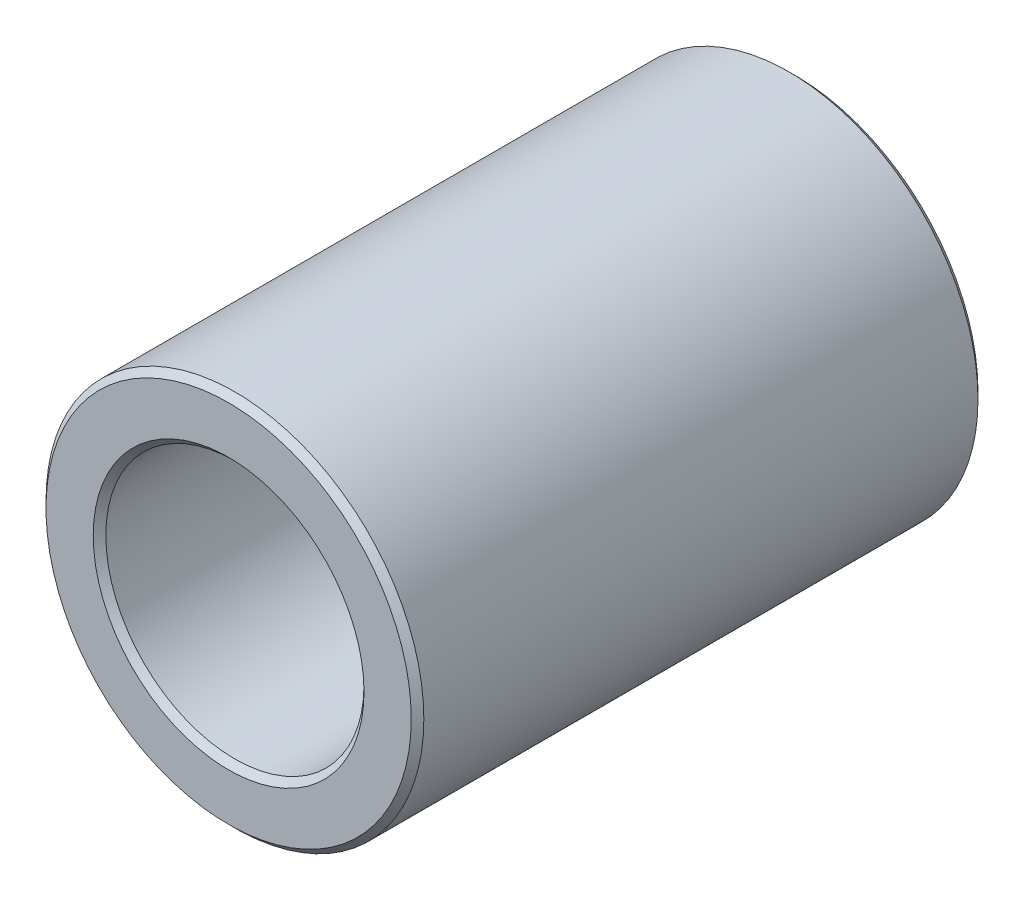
ISO-10303-21;
HEADER;
FILE_DESCRIPTION(('STEP AP214'),'2;1');
FILE_NAME('part.step','',(''),(''),'','','');
FILE_SCHEMA(('AUTOMOTIVE_DESIGN { 1 0 10303 214 1 1 1 1 }'));
ENDSEC;
DATA;
#1=APPLICATION_CONTEXT('core data for automotive mechanical design processes');
#2=APPLICATION_PROTOCOL_DEFINITION('international standard','automotive_design',2000,#1);
#3=PRODUCT_CONTEXT('',#1,'mechanical');
#4=PRODUCT('Part','Part','',(#3));
#5=PRODUCT_RELATED_PRODUCT_CATEGORY('part','',(#4));
#6=PRODUCT_DEFINITION_FORMATION('','',#4);
#7=PRODUCT_DEFINITION_CONTEXT('part definition',#1,'design');
#8=PRODUCT_DEFINITION('design','',#6,#7);
#9=PRODUCT_DEFINITION_SHAPE('','',#8);
#10=(LENGTH_UNIT() NAMED_UNIT(*) SI_UNIT(.MILLI.,.METRE.));
#11=(NAMED_UNIT(*) PLANE_ANGLE_UNIT() SI_UNIT($,.RADIAN.));
#12=(NAMED_UNIT(*) SI_UNIT($,.STERADIAN.) SOLID_ANGLE_UNIT());
#13=UNCERTAINTY_MEASURE_WITH_UNIT(LENGTH_MEASURE(1.E-05),#10,'distance_accuracy_value','');
#14=(GEOMETRIC_REPRESENTATION_CONTEXT(3) GLOBAL_UNCERTAINTY_ASSIGNED_CONTEXT((#13)) GLOBAL_UNIT_ASSIGNED_CONTEXT((#10,
#11,#12)) REPRESENTATION_CONTEXT('',''));
#15=CARTESIAN_POINT('',(0.,0.,0.));
#16=DIRECTION('',(0.,0.,1.));
#17=DIRECTION('',(1.,0.,0.));
#18=AXIS2_PLACEMENT_3D('',#15,#16,#17);
#19=CARTESIAN_POINT('',(0.,0.,9.));
#20=DIRECTION('',(0.,0.,1.));
#21=DIRECTION('',(1.,0.,0.));
#22=AXIS2_PLACEMENT_3D('',#19,#20,#21);
#23=PLANE('',#22);
#24=CARTESIAN_POINT('',(0.,0.,9.));
#25=DIRECTION('',(0.,0.,1.));
#26=DIRECTION('',(1.,0.,0.));
#27=AXIS2_PLACEMENT_3D('',#24,#25,#26);
#28=CIRCLE('',#27,4.30000000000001);
#29=CARTESIAN_POINT('',(4.30000000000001,0.,9.));
#30=VERTEX_POINT('',#29);
#31=EDGE_CURVE('E10',#30,#30,#28,.F.);
#32=ORIENTED_EDGE('',*,*,#31,.T.);
#33=EDGE_LOOP('',(#32));
#34=FACE_BOUND('',#33,.T.);
#35=CARTESIAN_POINT('',(0.,0.,9.));
#36=DIRECTION('',(0.,0.,1.));
#37=DIRECTION('',(1.,0.,0.));
#38=AXIS2_PLACEMENT_3D('',#35,#36,#37);
#39=CIRCLE('',#38,5.8);
#40=CARTESIAN_POINT('',(5.8,0.,9.));
#41=VERTEX_POINT('',#40);
#42=EDGE_CURVE('E45',#41,#41,#39,.T.);
#43=ORIENTED_EDGE('',*,*,#42,.T.);
#44=EDGE_LOOP('',(#43));
#45=FACE_BOUND('',#44,.T.);
#46=ADVANCED_FACE('F37',(#34,#45),#23,.T.);
#47=CARTESIAN_POINT('',(0.,0.,-9.));
#48=DIRECTION('',(0.,0.,1.));
#49=DIRECTION('',(1.,0.,0.));
#50=AXIS2_PLACEMENT_3D('',#47,#48,#49);
#51=PLANE('',#50);
#52=CARTESIAN_POINT('',(0.,0.,-9.));
#53=DIRECTION('',(0.,0.,1.));
#54=DIRECTION('',(1.,0.,0.));
#55=AXIS2_PLACEMENT_3D('',#52,#53,#54);
#56=CIRCLE('',#55,5.8);
#57=CARTESIAN_POINT('',(5.8,0.,-9.));
#58=VERTEX_POINT('',#57);
#59=EDGE_CURVE('E62',#58,#58,#56,.F.);
#60=ORIENTED_EDGE('',*,*,#59,.T.);
#61=EDGE_LOOP('',(#60));
#62=FACE_BOUND('',#61,.T.);
#63=CARTESIAN_POINT('',(0.,0.,-9.));
#64=DIRECTION('',(0.,0.,1.));
#65=DIRECTION('',(1.,0.,0.));
#66=AXIS2_PLACEMENT_3D('',#63,#64,#65);
#67=CIRCLE('',#66,4.3);
#68=CARTESIAN_POINT('',(4.3,0.,-9.));
#69=VERTEX_POINT('',#68);
#70=EDGE_CURVE('E65',#69,#69,#67,.T.);
#71=ORIENTED_EDGE('',*,*,#70,.T.);
#72=EDGE_LOOP('',(#71));
#73=FACE_BOUND('',#72,.T.);
#74=ADVANCED_FACE('F89',(#62,#73),#51,.F.);
#75=CARTESIAN_POINT('',(0.,0.,9.));
#76=DIRECTION('',(0.,0.,-1.));
#77=DIRECTION('',(-1.,0.,0.));
#78=AXIS2_PLACEMENT_3D('',#75,#76,#77);
#79=CYLINDRICAL_SURFACE('',#78,6.);
#80=CARTESIAN_POINT('',(0.,0.,-8.8));
#81=DIRECTION('',(0.,0.,1.));
#82=DIRECTION('',(1.,0.,0.));
#83=AXIS2_PLACEMENT_3D('',#80,#81,#82);
#84=CIRCLE('',#83,6.);
#85=CARTESIAN_POINT('',(6.,0.,-8.8));
#86=VERTEX_POINT('',#85);
#87=EDGE_CURVE('E69',#86,#86,#84,.T.);
#88=ORIENTED_EDGE('',*,*,#87,.T.);
#89=EDGE_LOOP('',(#88));
#90=FACE_BOUND('',#89,.T.);
#91=CARTESIAN_POINT('',(0.,0.,8.8));
#92=DIRECTION('',(0.,0.,1.));
#93=DIRECTION('',(1.,0.,0.));
#94=AXIS2_PLACEMENT_3D('',#91,#92,#93);
#95=CIRCLE('',#94,6.);
#96=CARTESIAN_POINT('',(6.,0.,8.8));
#97=VERTEX_POINT('',#96);
#98=EDGE_CURVE('E73',#97,#97,#95,.F.);
#99=ORIENTED_EDGE('',*,*,#98,.T.);
#100=EDGE_LOOP('',(#99));
#101=FACE_BOUND('',#100,.T.);
#102=ADVANCED_FACE('F78',(#90,#101),#79,.T.);
#103=CARTESIAN_POINT('',(0.,0.,9.));
#104=DIRECTION('',(0.,0.,-1.));
#105=DIRECTION('',(-1.,0.,0.));
#106=AXIS2_PLACEMENT_3D('',#103,#104,#105);
#107=CYLINDRICAL_SURFACE('',#106,4.1);
#108=CARTESIAN_POINT('',(0.,0.,-8.8));
#109=DIRECTION('',(0.,0.,1.));
#110=DIRECTION('',(1.,0.,0.));
#111=AXIS2_PLACEMENT_3D('',#108,#109,#110);
#112=CIRCLE('',#111,4.1);
#113=CARTESIAN_POINT('',(4.1,0.,-8.8));
#114=VERTEX_POINT('',#113);
#115=EDGE_CURVE('E51',#114,#114,#112,.F.);
#116=ORIENTED_EDGE('',*,*,#115,.T.);
#117=EDGE_LOOP('',(#116));
#118=FACE_BOUND('',#117,.T.);
#119=CARTESIAN_POINT('',(0.,0.,8.79999999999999));
#120=DIRECTION('',(0.,0.,1.));
#121=DIRECTION('',(1.,0.,0.));
#122=AXIS2_PLACEMENT_3D('',#119,#120,#121);
#123=CIRCLE('',#122,4.1);
#124=CARTESIAN_POINT('',(4.1,0.,8.79999999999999));
#125=VERTEX_POINT('',#124);
#126=EDGE_CURVE('E56',#125,#125,#123,.T.);
#127=ORIENTED_EDGE('',*,*,#126,.T.);
#128=EDGE_LOOP('',(#127));
#129=FACE_BOUND('',#128,.T.);
#130=ADVANCED_FACE('F97',(#118,#129),#107,.F.);
#131=CARTESIAN_POINT('',(0.,0.,-8.8));
#132=DIRECTION('',(0.,0.,1.));
#133=DIRECTION('',(1.,0.,0.));
#134=AXIS2_PLACEMENT_3D('',#131,#132,#133);
#135=CONICAL_SURFACE('',#134,6.,0.78539816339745);
#136=ORIENTED_EDGE('',*,*,#59,.F.);
#137=EDGE_LOOP('',(#136));
#138=FACE_BOUND('',#137,.T.);
#139=ORIENTED_EDGE('',*,*,#87,.F.);
#140=EDGE_LOOP('',(#139));
#141=FACE_BOUND('',#140,.T.);
#142=ADVANCED_FACE('F102',(#138,#141),#135,.T.);
#143=CARTESIAN_POINT('',(0.,0.,-9.));
#144=DIRECTION('',(0.,0.,-1.));
#145=DIRECTION('',(-1.,0.,0.));
#146=AXIS2_PLACEMENT_3D('',#143,#144,#145);
#147=CONICAL_SURFACE('',#146,4.3,0.785398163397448);
#148=ORIENTED_EDGE('',*,*,#115,.F.);
#149=EDGE_LOOP('',(#148));
#150=FACE_BOUND('',#149,.T.);
#151=ORIENTED_EDGE('',*,*,#70,.F.);
#152=EDGE_LOOP('',(#151));
#153=FACE_BOUND('',#152,.T.);
#154=ADVANCED_FACE('F86',(#150,#153),#147,.F.);
#155=CARTESIAN_POINT('',(0.,0.,8.79999999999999));
#156=DIRECTION('',(0.,0.,1.));
#157=DIRECTION('',(1.,0.,0.));
#158=AXIS2_PLACEMENT_3D('',#155,#156,#157);
#159=CONICAL_SURFACE('',#158,4.1,0.785398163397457);
#160=ORIENTED_EDGE('',*,*,#31,.F.);
#161=EDGE_LOOP('',(#160));
#162=FACE_BOUND('',#161,.T.);
#163=ORIENTED_EDGE('',*,*,#126,.F.);
#164=EDGE_LOOP('',(#163));
#165=FACE_BOUND('',#164,.T.);
#166=ADVANCED_FACE('F82',(#162,#165),#159,.F.);
#167=CARTESIAN_POINT('',(0.,0.,9.));
#168=DIRECTION('',(0.,0.,-1.));
#169=DIRECTION('',(-1.,0.,0.));
#170=AXIS2_PLACEMENT_3D('',#167,#168,#169);
#171=CONICAL_SURFACE('',#170,5.8,0.785398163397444);
#172=ORIENTED_EDGE('',*,*,#98,.F.);
#173=EDGE_LOOP('',(#172));
#174=FACE_BOUND('',#173,.T.);
#175=ORIENTED_EDGE('',*,*,#42,.F.);
#176=EDGE_LOOP('',(#175));
#177=FACE_BOUND('',#176,.T.);
#178=ADVANCED_FACE('F39',(#174,#177),#171,.T.);
#179=CLOSED_SHELL('',(#46,#74,#102,#130,#142,#154,#166,#178));
#180=MANIFOLD_SOLID_BREP('B2',#179);
#181=ADVANCED_BREP_SHAPE_REPRESENTATION('',(#18,#180),#14);
#182=SHAPE_DEFINITION_REPRESENTATION(#9,#181);
ENDSEC;
END-ISO-10303-21;
